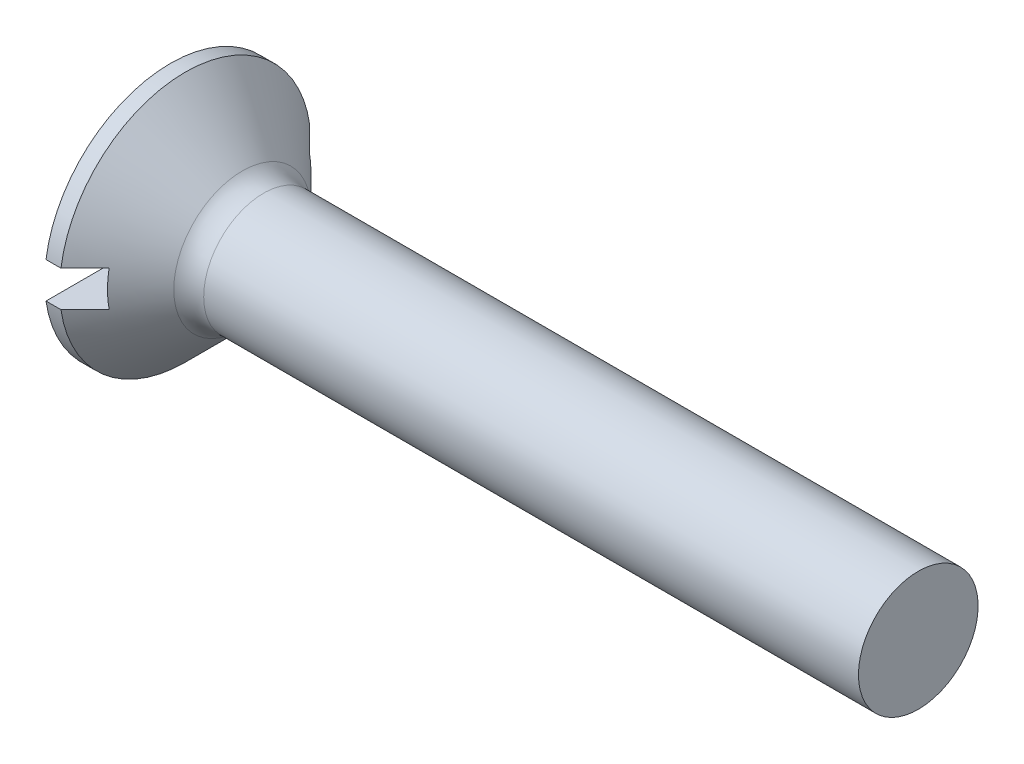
ISO-10303-21;
HEADER;
FILE_DESCRIPTION(('STEP AP214'),'2;1');
FILE_NAME('part.step','',(''),(''),'','','');
FILE_SCHEMA(('AUTOMOTIVE_DESIGN { 1 0 10303 214 1 1 1 1 }'));
ENDSEC;
DATA;
#1=APPLICATION_CONTEXT('core data for automotive mechanical design processes');
#2=APPLICATION_PROTOCOL_DEFINITION('international standard','automotive_design',2000,#1);
#3=PRODUCT_CONTEXT('',#1,'mechanical');
#4=PRODUCT('Part','Part','',(#3));
#5=PRODUCT_RELATED_PRODUCT_CATEGORY('part','',(#4));
#6=PRODUCT_DEFINITION_FORMATION('','',#4);
#7=PRODUCT_DEFINITION_CONTEXT('part definition',#1,'design');
#8=PRODUCT_DEFINITION('design','',#6,#7);
#9=PRODUCT_DEFINITION_SHAPE('','',#8);
#10=(LENGTH_UNIT() NAMED_UNIT(*) SI_UNIT(.MILLI.,.METRE.));
#11=(NAMED_UNIT(*) PLANE_ANGLE_UNIT() SI_UNIT($,.RADIAN.));
#12=(NAMED_UNIT(*) SI_UNIT($,.STERADIAN.) SOLID_ANGLE_UNIT());
#13=UNCERTAINTY_MEASURE_WITH_UNIT(LENGTH_MEASURE(1.E-05),#10,'distance_accuracy_value','');
#14=(GEOMETRIC_REPRESENTATION_CONTEXT(3) GLOBAL_UNCERTAINTY_ASSIGNED_CONTEXT((#13)) GLOBAL_UNIT_ASSIGNED_CONTEXT((#10,
#11,#12)) REPRESENTATION_CONTEXT('',''));
#15=CARTESIAN_POINT('',(0.,0.,0.));
#16=DIRECTION('',(0.,0.,1.));
#17=DIRECTION('',(1.,0.,0.));
#18=AXIS2_PLACEMENT_3D('',#15,#16,#17);
#19=CARTESIAN_POINT('',(0.,0.,0.));
#20=DIRECTION('',(-1.,0.,0.));
#21=DIRECTION('',(0.,0.,1.));
#22=AXIS2_PLACEMENT_3D('',#19,#20,#21);
#23=PLANE('',#22);
#24=DIRECTION('',(0.,0.,-1.));
#25=VECTOR('',#24,1.);
#26=CARTESIAN_POINT('',(0.,0.6,4.2));
#27=LINE('',#26,#25);
#28=CARTESIAN_POINT('',(0.,0.6,4.15692193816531));
#29=VERTEX_POINT('',#28);
#30=CARTESIAN_POINT('',(0.,0.599999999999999,-4.15692193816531));
#31=VERTEX_POINT('',#30);
#32=EDGE_CURVE('E174',#29,#31,#27,.T.);
#33=ORIENTED_EDGE('',*,*,#32,.F.);
#34=CARTESIAN_POINT('',(0.,0.,0.));
#35=DIRECTION('',(-1.,0.,0.));
#36=DIRECTION('',(0.,0.,1.));
#37=AXIS2_PLACEMENT_3D('',#34,#35,#36);
#38=CIRCLE('',#37,4.2);
#39=EDGE_CURVE('E118',#29,#31,#38,.T.);
#40=ORIENTED_EDGE('',*,*,#39,.T.);
#41=EDGE_LOOP('',(#33,#40));
#42=FACE_BOUND('',#41,.T.);
#43=ADVANCED_FACE('F37',(#42),#23,.T.);
#44=CARTESIAN_POINT('',(-6.34999999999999,0.,0.));
#45=DIRECTION('',(-1.,0.,0.));
#46=DIRECTION('',(0.,0.,1.));
#47=AXIS2_PLACEMENT_3D('',#44,#45,#46);
#48=CYLINDRICAL_SURFACE('',#47,4.2);
#49=DIRECTION('',(-1.,0.,0.));
#50=VECTOR('',#49,1.);
#51=CARTESIAN_POINT('',(-6.34999999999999,0.599999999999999,-4.15692193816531));
#52=LINE('',#51,#50);
#53=CARTESIAN_POINT('',(0.500000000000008,0.599999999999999,-4.15692193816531));
#54=VERTEX_POINT('',#53);
#55=EDGE_CURVE('E65',#31,#54,#52,.F.);
#56=ORIENTED_EDGE('',*,*,#55,.F.);
#57=ORIENTED_EDGE('',*,*,#39,.F.);
#58=DIRECTION('',(-1.,0.,0.));
#59=VECTOR('',#58,1.);
#60=CARTESIAN_POINT('',(-6.34999999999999,0.6,4.15692193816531));
#61=LINE('',#60,#59);
#62=CARTESIAN_POINT('',(0.500000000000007,0.6,4.15692193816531));
#63=VERTEX_POINT('',#62);
#64=EDGE_CURVE('E180',#63,#29,#61,.T.);
#65=ORIENTED_EDGE('',*,*,#64,.F.);
#66=CARTESIAN_POINT('',(0.500000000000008,0.,0.));
#67=DIRECTION('',(-1.,0.,0.));
#68=DIRECTION('',(0.,0.,1.));
#69=AXIS2_PLACEMENT_3D('',#66,#67,#68);
#70=CIRCLE('',#69,4.2);
#71=EDGE_CURVE('E112',#63,#54,#70,.T.);
#72=ORIENTED_EDGE('',*,*,#71,.T.);
#73=EDGE_LOOP('',(#56,#57,#65,#72));
#74=FACE_BOUND('',#73,.T.);
#75=ADVANCED_FACE('F158',(#74),#48,.T.);
#76=DIRECTION('',(0.,0.,1.));
#77=VECTOR('',#76,1.);
#78=CARTESIAN_POINT('',(0.,-0.600000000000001,-4.2));
#79=LINE('',#78,#77);
#80=CARTESIAN_POINT('',(0.,-0.600000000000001,-4.15692193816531));
#81=VERTEX_POINT('',#80);
#82=CARTESIAN_POINT('',(0.,-0.600000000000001,4.15692193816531));
#83=VERTEX_POINT('',#82);
#84=EDGE_CURVE('E106',#81,#83,#79,.T.);
#85=ORIENTED_EDGE('',*,*,#84,.F.);
#86=EDGE_CURVE('E114',#81,#83,#38,.T.);
#87=ORIENTED_EDGE('',*,*,#86,.T.);
#88=EDGE_LOOP('',(#85,#87));
#89=FACE_BOUND('',#88,.T.);
#90=ADVANCED_FACE('F160',(#89),#23,.T.);
#91=DIRECTION('',(-1.,0.,0.));
#92=VECTOR('',#91,1.);
#93=CARTESIAN_POINT('',(-6.34999999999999,-0.600000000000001,4.15692193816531));
#94=LINE('',#93,#92);
#95=CARTESIAN_POINT('',(0.500000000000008,-0.600000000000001,4.15692193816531));
#96=VERTEX_POINT('',#95);
#97=EDGE_CURVE('E179',#83,#96,#94,.F.);
#98=ORIENTED_EDGE('',*,*,#97,.F.);
#99=ORIENTED_EDGE('',*,*,#86,.F.);
#100=DIRECTION('',(-1.,0.,0.));
#101=VECTOR('',#100,1.);
#102=CARTESIAN_POINT('',(-6.34999999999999,-0.600000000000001,-4.15692193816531));
#103=LINE('',#102,#101);
#104=CARTESIAN_POINT('',(0.500000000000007,-0.600000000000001,-4.15692193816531));
#105=VERTEX_POINT('',#104);
#106=EDGE_CURVE('E177',#105,#81,#103,.T.);
#107=ORIENTED_EDGE('',*,*,#106,.F.);
#108=EDGE_CURVE('E115',#105,#96,#70,.T.);
#109=ORIENTED_EDGE('',*,*,#108,.T.);
#110=EDGE_LOOP('',(#98,#99,#107,#109));
#111=FACE_BOUND('',#110,.T.);
#112=ADVANCED_FACE('F155',(#111),#48,.T.);
#113=CARTESIAN_POINT('',(0.500000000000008,0.,0.));
#114=DIRECTION('',(-1.,0.,0.));
#115=DIRECTION('',(0.,0.,1.));
#116=AXIS2_PLACEMENT_3D('',#113,#114,#115);
#117=CONICAL_SURFACE('',#116,4.2,0.78539816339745);
#118=CARTESIAN_POINT('',(-4.56300554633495,0.599999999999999,-9.24355298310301));
#119=CARTESIAN_POINT('',(-4.24600723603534,0.599999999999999,-8.9258823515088));
#120=CARTESIAN_POINT('',(-3.92903833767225,0.599999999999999,-8.60818235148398));
#121=CARTESIAN_POINT('',(-3.29519089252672,0.599999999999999,-7.97268003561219));
#122=CARTESIAN_POINT('',(-2.97831234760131,0.599999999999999,-7.65487771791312));
#123=CARTESIAN_POINT('',(-2.34455187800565,0.599999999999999,-7.01900148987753));
#124=CARTESIAN_POINT('',(-2.02767001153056,0.599999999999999,-6.70092752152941));
#125=CARTESIAN_POINT('',(-1.39411705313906,0.599999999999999,-6.06458161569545));
#126=CARTESIAN_POINT('',(-1.07744595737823,0.599999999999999,-5.74630968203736));
#127=CARTESIAN_POINT('',(-0.439782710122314,0.599999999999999,-5.1047678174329));
#128=CARTESIAN_POINT('',(-0.118795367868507,0.599999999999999,-4.78149310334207));
#129=CARTESIAN_POINT('',(0.362237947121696,0.599999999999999,-4.2961185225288));
#130=CARTESIAN_POINT('',(0.522512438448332,0.599999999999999,-4.13424518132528));
#131=CARTESIAN_POINT('',(0.842841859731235,0.599999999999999,-3.81028322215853));
#132=CARTESIAN_POINT('',(1.00289679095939,0.6,-3.64819460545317));
#133=CARTESIAN_POINT('',(1.32264436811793,0.6,-3.32374686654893));
#134=CARTESIAN_POINT('',(1.48233710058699,0.6,-3.16138782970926));
#135=CARTESIAN_POINT('',(1.80122734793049,0.6,-2.83617699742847));
#136=CARTESIAN_POINT('',(1.96042485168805,0.6,-2.67332519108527));
#137=CARTESIAN_POINT('',(2.27798310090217,0.6,-2.346837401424));
#138=CARTESIAN_POINT('',(2.43634393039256,0.6,-2.1832015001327));
#139=CARTESIAN_POINT('',(2.67269924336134,0.6,-1.93661567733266));
#140=CARTESIAN_POINT('',(2.75128528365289,0.6,-1.8542332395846));
#141=CARTESIAN_POINT('',(2.90787263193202,0.6,-1.68891500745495));
#142=CARTESIAN_POINT('',(2.98587394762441,0.6,-1.60597922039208));
#143=CARTESIAN_POINT('',(3.10544684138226,0.6,-1.47745401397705));
#144=CARTESIAN_POINT('',(3.14733724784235,0.6,-1.43216144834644));
#145=CARTESIAN_POINT('',(3.23076972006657,0.6,-1.34125476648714));
#146=CARTESIAN_POINT('',(3.27231177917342,0.6,-1.29564064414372));
#147=CARTESIAN_POINT('',(3.35490511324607,0.6,-1.20402456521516));
#148=CARTESIAN_POINT('',(3.39595670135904,0.6,-1.15802289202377));
#149=CARTESIAN_POINT('',(3.47741398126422,0.6,-1.06545539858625));
#150=CARTESIAN_POINT('',(3.51781969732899,0.6,-1.01888959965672));
#151=CARTESIAN_POINT('',(3.61534617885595,0.6,-0.904304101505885));
#152=CARTESIAN_POINT('',(3.67198890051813,0.6,-0.835870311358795));
#153=CARTESIAN_POINT('',(3.75443491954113,0.6,-0.731128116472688));
#154=CARTESIAN_POINT('',(3.78151872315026,0.6,-0.695835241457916));
#155=CARTESIAN_POINT('',(3.83442818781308,0.6,-0.624333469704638));
#156=CARTESIAN_POINT('',(3.86025411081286,0.6,-0.588124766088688));
#157=CARTESIAN_POINT('',(3.91931375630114,0.6,-0.500871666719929));
#158=CARTESIAN_POINT('',(3.95177061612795,0.6,-0.449276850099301));
#159=CARTESIAN_POINT('',(3.99577967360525,0.6,-0.369336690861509));
#160=CARTESIAN_POINT('',(4.00966067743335,0.6,-0.342288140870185));
#161=CARTESIAN_POINT('',(4.03525638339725,0.6,-0.287195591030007));
#162=CARTESIAN_POINT('',(4.04697271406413,0.6,-0.259152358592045));
#163=CARTESIAN_POINT('',(4.06984222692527,0.6,-0.195380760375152));
#164=CARTESIAN_POINT('',(4.08024433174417,0.6,-0.159369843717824));
#165=CARTESIAN_POINT('',(4.09489065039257,0.6,-0.0861793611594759));
#166=CARTESIAN_POINT('',(4.09915715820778,0.6,-0.049004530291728));
#167=CARTESIAN_POINT('',(4.10061628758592,0.6,0.0256851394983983));
#168=CARTESIAN_POINT('',(4.09777267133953,0.6,0.0632007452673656));
#169=CARTESIAN_POINT('',(4.08560858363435,0.6,0.137201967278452));
#170=CARTESIAN_POINT('',(4.0762699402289,0.6,0.173684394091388));
#171=CARTESIAN_POINT('',(4.05240105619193,0.6,0.246171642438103));
#172=CARTESIAN_POINT('',(4.03770931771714,0.6,0.282120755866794));
#173=CARTESIAN_POINT('',(4.0048507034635,0.6,0.352421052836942));
#174=CARTESIAN_POINT('',(3.98667753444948,0.6,0.386769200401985));
#175=CARTESIAN_POINT('',(3.94786976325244,0.6,0.454391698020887));
#176=CARTESIAN_POINT('',(3.92721638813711,0.6,0.487655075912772));
#177=CARTESIAN_POINT('',(3.88433578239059,0.6,0.553097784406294));
#178=CARTESIAN_POINT('',(3.86210991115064,0.6,0.585278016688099));
#179=CARTESIAN_POINT('',(3.81457382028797,0.6,0.651581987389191));
#180=CARTESIAN_POINT('',(3.7891630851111,0.6,0.685633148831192));
#181=CARTESIAN_POINT('',(3.73740972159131,0.6,0.75302228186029));
#182=CARTESIAN_POINT('',(3.71106696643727,0.6,0.786360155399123));
#183=CARTESIAN_POINT('',(3.63101189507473,0.6,0.885596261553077));
#184=CARTESIAN_POINT('',(3.57629754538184,0.6,0.950683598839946));
#185=CARTESIAN_POINT('',(3.46525380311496,0.6,1.07965626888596));
#186=CARTESIAN_POINT('',(3.40892163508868,0.6,1.14353918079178));
#187=CARTESIAN_POINT('',(3.29530585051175,0.6,1.27041803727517));
#188=CARTESIAN_POINT('',(3.23802251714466,0.6,1.33341423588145));
#189=CARTESIAN_POINT('',(3.12298479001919,0.6,1.45862383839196));
#190=CARTESIAN_POINT('',(3.06523233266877,0.6,1.52083902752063));
#191=CARTESIAN_POINT('',(2.94927074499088,0.6,1.64485037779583));
#192=CARTESIAN_POINT('',(2.89106158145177,0.6,1.70664650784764));
#193=CARTESIAN_POINT('',(2.71607782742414,0.6,1.89143620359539));
#194=CARTESIAN_POINT('',(2.598818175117,0.6,2.01396998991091));
#195=CARTESIAN_POINT('',(2.36411448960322,0.6,2.25774708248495));
#196=CARTESIAN_POINT('',(2.24667393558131,0.6,2.37899374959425));
#197=CARTESIAN_POINT('',(2.01132064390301,0.6,2.6210282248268));
#198=CARTESIAN_POINT('',(1.89340790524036,0.6,2.74181603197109));
#199=CARTESIAN_POINT('',(1.53920067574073,0.6,3.10372997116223));
#200=CARTESIAN_POINT('',(1.30244210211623,0.6,3.3444015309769));
#201=CARTESIAN_POINT('',(0.82819572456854,0.6,3.82523070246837));
#202=CARTESIAN_POINT('',(0.5907076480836,0.6,4.06538804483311));
#203=CARTESIAN_POINT('',(0.115359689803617,0.6,4.54532999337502));
#204=CARTESIAN_POINT('',(-0.122500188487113,0.6,4.7851146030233));
#205=CARTESIAN_POINT('',(-0.598435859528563,0.6,5.26442998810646));
#206=CARTESIAN_POINT('',(-0.836511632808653,0.6,5.50396078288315));
#207=CARTESIAN_POINT('',(-1.31282357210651,0.6,5.98286400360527));
#208=CARTESIAN_POINT('',(-1.55105973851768,0.600000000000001,6.22223642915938));
#209=CARTESIAN_POINT('',(-2.26588146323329,0.600000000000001,6.94013600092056));
#210=CARTESIAN_POINT('',(-2.74263267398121,0.600000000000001,7.41849819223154));
#211=CARTESIAN_POINT('',(-3.33143893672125,0.600000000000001,8.00899983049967));
#212=CARTESIAN_POINT('',(-3.44338145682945,0.600000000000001,8.1212515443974));
#213=CARTESIAN_POINT('',(-3.66728071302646,0.600000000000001,8.34574469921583));
#214=CARTESIAN_POINT('',(-3.7792374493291,0.600000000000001,8.45798613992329));
#215=CARTESIAN_POINT('',(-4.00315821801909,0.600000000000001,8.68245495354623));
#216=CARTESIAN_POINT('',(-4.11512225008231,0.600000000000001,8.79468232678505));
#217=CARTESIAN_POINT('',(-4.33905795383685,0.600000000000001,9.01912554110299));
#218=CARTESIAN_POINT('',(-4.45102962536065,0.600000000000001,9.13134138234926));
#219=CARTESIAN_POINT('',(-4.56300554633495,0.600000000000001,9.24355298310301));
#220=B_SPLINE_CURVE_WITH_KNOTS('',3,(#118,#119,#120,#121,#122,#123,#124,#125,#126,#127,#128,
#129,#130,#131,#132,#133,#134,#135,#136,#137,#138,#139,#140,#141,#142,#143,#144,#145,#146,#147,
#148,#149,#150,#151,#152,#153,#154,#155,#156,#157,#158,#159,#160,#161,#162,#163,#164,#165,#166,
#167,#168,#169,#170,#171,#172,#173,#174,#175,#176,#177,#178,#179,#180,#181,#182,#183,#184,#185,
#186,#187,#188,#189,#190,#191,#192,#193,#194,#195,#196,#197,#198,#199,#200,#201,#202,#203,#204,
#205,#206,#207,#208,#209,#210,#211,#212,#213,#214,#215,#216,#217,#218,#219),.UNSPECIFIED.,.F.,
.F.,(4,2,2,2,2,2,2,2,2,2,2,2,2,2,2,2,2,2,2,2,2,2,2,2,2,2,2,2,2,2,2,2,2,2,2,2,2,2,2,2,2,2,2,2,2,
2,2,2,2,2,4),(0.,1.34633691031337,2.6926997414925,4.03964677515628,5.38656852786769,
6.75326280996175,7.43664982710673,8.12003286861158,8.80323043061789,9.48644321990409,
10.1695860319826,10.5111450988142,10.8526996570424,11.03778202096,11.2228679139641,
11.4078285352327,11.5927821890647,11.8592146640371,11.9926530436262,12.1260635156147,
12.3086320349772,12.399769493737,12.490838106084,12.6028793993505,12.7145125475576,
12.8267158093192,12.939234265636,13.0554743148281,13.1719265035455,13.2893234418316,
13.4066201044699,13.5340600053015,13.6615173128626,13.91655652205,14.1720630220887,
14.4274947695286,14.6821578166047,14.9368395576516,15.4456347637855,15.9520298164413,
16.4584259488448,17.4712394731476,18.484493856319,19.4977387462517,20.5108998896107,
21.5240635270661,23.5501676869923,24.0257559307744,24.5013524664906,24.9769345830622,
25.4525083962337),.UNSPECIFIED.);
#221=CARTESIAN_POINT('',(1.3,0.6,3.34664010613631));
#222=VERTEX_POINT('',#221);
#223=EDGE_CURVE('E11',#222,#63,#220,.T.);
#224=ORIENTED_EDGE('',*,*,#223,.F.);
#225=CARTESIAN_POINT('',(1.3,0.,0.));
#226=DIRECTION('',(1.,0.,0.));
#227=DIRECTION('',(0.,0.,-1.));
#228=AXIS2_PLACEMENT_3D('',#225,#226,#227);
#229=CIRCLE('',#228,3.40000000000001);
#230=CARTESIAN_POINT('',(1.3,-0.600000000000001,3.34664010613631));
#231=VERTEX_POINT('',#230);
#232=EDGE_CURVE('E94',#231,#222,#229,.F.);
#233=ORIENTED_EDGE('',*,*,#232,.F.);
#234=CARTESIAN_POINT('',(-4.56300554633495,-0.600000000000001,9.24355298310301));
#235=CARTESIAN_POINT('',(-4.24600723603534,-0.600000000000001,8.9258823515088));
#236=CARTESIAN_POINT('',(-3.92903833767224,-0.600000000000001,8.60818235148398));
#237=CARTESIAN_POINT('',(-3.29519089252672,-0.600000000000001,7.97268003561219));
#238=CARTESIAN_POINT('',(-2.9783123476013,-0.600000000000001,7.65487771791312));
#239=CARTESIAN_POINT('',(-2.34455187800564,-0.600000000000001,7.01900148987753));
#240=CARTESIAN_POINT('',(-2.02767001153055,-0.600000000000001,6.70092752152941));
#241=CARTESIAN_POINT('',(-1.39411705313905,-0.600000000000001,6.06458161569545));
#242=CARTESIAN_POINT('',(-1.07744595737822,-0.600000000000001,5.74630968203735));
#243=CARTESIAN_POINT('',(-0.439782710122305,-0.600000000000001,5.10476781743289));
#244=CARTESIAN_POINT('',(-0.1187953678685,-0.600000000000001,4.78149310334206));
#245=CARTESIAN_POINT('',(0.362237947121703,-0.600000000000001,4.29611852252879));
#246=CARTESIAN_POINT('',(0.522512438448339,-0.600000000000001,4.13424518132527));
#247=CARTESIAN_POINT('',(0.842841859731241,-0.600000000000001,3.81028322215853));
#248=CARTESIAN_POINT('',(1.00289679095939,-0.600000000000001,3.64819460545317));
#249=CARTESIAN_POINT('',(1.32264436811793,-0.600000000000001,3.32374686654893));
#250=CARTESIAN_POINT('',(1.482337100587,-0.600000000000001,3.16138782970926));
#251=CARTESIAN_POINT('',(1.80122734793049,-0.600000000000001,2.83617699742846));
#252=CARTESIAN_POINT('',(1.96042485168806,-0.600000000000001,2.67332519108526));
#253=CARTESIAN_POINT('',(2.27798310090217,-0.600000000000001,2.346837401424));
#254=CARTESIAN_POINT('',(2.43634393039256,-0.600000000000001,2.1832015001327));
#255=CARTESIAN_POINT('',(2.67269924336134,-0.600000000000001,1.93661567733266));
#256=CARTESIAN_POINT('',(2.75128528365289,-0.600000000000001,1.8542332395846));
#257=CARTESIAN_POINT('',(2.90787263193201,-0.600000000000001,1.68891500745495));
#258=CARTESIAN_POINT('',(2.98587394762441,-0.600000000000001,1.60597922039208));
#259=CARTESIAN_POINT('',(3.10544684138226,-0.600000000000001,1.47745401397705));
#260=CARTESIAN_POINT('',(3.14733724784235,-0.600000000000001,1.43216144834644));
#261=CARTESIAN_POINT('',(3.23076972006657,-0.600000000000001,1.34125476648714));
#262=CARTESIAN_POINT('',(3.27231177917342,-0.600000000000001,1.29564064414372));
#263=CARTESIAN_POINT('',(3.35490511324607,-0.600000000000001,1.20402456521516));
#264=CARTESIAN_POINT('',(3.39595670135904,-0.600000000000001,1.15802289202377));
#265=CARTESIAN_POINT('',(3.47741398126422,-0.600000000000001,1.06545539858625));
#266=CARTESIAN_POINT('',(3.51781969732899,-0.600000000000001,1.01888959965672));
#267=CARTESIAN_POINT('',(3.61534617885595,-0.600000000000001,0.904304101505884));
#268=CARTESIAN_POINT('',(3.67198890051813,-0.600000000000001,0.835870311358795));
#269=CARTESIAN_POINT('',(3.75443491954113,-0.600000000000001,0.731128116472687));
#270=CARTESIAN_POINT('',(3.78151872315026,-0.600000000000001,0.695835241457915));
#271=CARTESIAN_POINT('',(3.83442818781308,-0.600000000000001,0.624333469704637));
#272=CARTESIAN_POINT('',(3.86025411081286,-0.600000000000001,0.588124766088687));
#273=CARTESIAN_POINT('',(3.91931375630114,-0.600000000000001,0.500871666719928));
#274=CARTESIAN_POINT('',(3.95177061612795,-0.600000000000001,0.449276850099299));
#275=CARTESIAN_POINT('',(3.99577967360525,-0.600000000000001,0.369336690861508));
#276=CARTESIAN_POINT('',(4.00966067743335,-0.600000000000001,0.342288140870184));
#277=CARTESIAN_POINT('',(4.03525638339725,-0.600000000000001,0.287195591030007));
#278=CARTESIAN_POINT('',(4.04697271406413,-0.600000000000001,0.259152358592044));
#279=CARTESIAN_POINT('',(4.06984222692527,-0.600000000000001,0.195380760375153));
#280=CARTESIAN_POINT('',(4.08024433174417,-0.600000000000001,0.159369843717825));
#281=CARTESIAN_POINT('',(4.09489065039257,-0.600000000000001,0.086179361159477));
#282=CARTESIAN_POINT('',(4.09915715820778,-0.600000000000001,0.0490045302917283));
#283=CARTESIAN_POINT('',(4.10061628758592,-0.600000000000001,-0.025685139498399));
#284=CARTESIAN_POINT('',(4.09777267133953,-0.600000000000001,-0.0632007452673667));
#285=CARTESIAN_POINT('',(4.08560858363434,-0.600000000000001,-0.137201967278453));
#286=CARTESIAN_POINT('',(4.07626994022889,-0.600000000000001,-0.173684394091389));
#287=CARTESIAN_POINT('',(4.05240105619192,-0.600000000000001,-0.246171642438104));
#288=CARTESIAN_POINT('',(4.03770931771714,-0.600000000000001,-0.282120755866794));
#289=CARTESIAN_POINT('',(4.0048507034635,-0.600000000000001,-0.352421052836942));
#290=CARTESIAN_POINT('',(3.98667753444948,-0.600000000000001,-0.386769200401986));
#291=CARTESIAN_POINT('',(3.94786976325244,-0.600000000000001,-0.454391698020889));
#292=CARTESIAN_POINT('',(3.92721638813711,-0.600000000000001,-0.487655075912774));
#293=CARTESIAN_POINT('',(3.88433578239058,-0.600000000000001,-0.553097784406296));
#294=CARTESIAN_POINT('',(3.86210991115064,-0.600000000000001,-0.585278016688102));
#295=CARTESIAN_POINT('',(3.81457382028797,-0.600000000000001,-0.651581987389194));
#296=CARTESIAN_POINT('',(3.7891630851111,-0.600000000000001,-0.685633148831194));
#297=CARTESIAN_POINT('',(3.73740972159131,-0.600000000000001,-0.753022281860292));
#298=CARTESIAN_POINT('',(3.71106696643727,-0.600000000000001,-0.786360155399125));
#299=CARTESIAN_POINT('',(3.63101189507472,-0.600000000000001,-0.88559626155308));
#300=CARTESIAN_POINT('',(3.57629754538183,-0.600000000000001,-0.95068359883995));
#301=CARTESIAN_POINT('',(3.46525380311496,-0.600000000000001,-1.07965626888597));
#302=CARTESIAN_POINT('',(3.40892163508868,-0.600000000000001,-1.14353918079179));
#303=CARTESIAN_POINT('',(3.29530585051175,-0.600000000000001,-1.27041803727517));
#304=CARTESIAN_POINT('',(3.23802251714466,-0.600000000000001,-1.33341423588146));
#305=CARTESIAN_POINT('',(3.12298479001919,-0.600000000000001,-1.45862383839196));
#306=CARTESIAN_POINT('',(3.06523233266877,-0.600000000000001,-1.52083902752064));
#307=CARTESIAN_POINT('',(2.94927074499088,-0.600000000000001,-1.64485037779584));
#308=CARTESIAN_POINT('',(2.89106158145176,-0.600000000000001,-1.70664650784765));
#309=CARTESIAN_POINT('',(2.71607782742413,-0.600000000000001,-1.8914362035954));
#310=CARTESIAN_POINT('',(2.598818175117,-0.600000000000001,-2.01396998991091));
#311=CARTESIAN_POINT('',(2.36411448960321,-0.600000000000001,-2.25774708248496));
#312=CARTESIAN_POINT('',(2.2466739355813,-0.600000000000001,-2.37899374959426));
#313=CARTESIAN_POINT('',(2.011320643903,-0.600000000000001,-2.62102822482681));
#314=CARTESIAN_POINT('',(1.89340790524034,-0.600000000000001,-2.74181603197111));
#315=CARTESIAN_POINT('',(1.53920067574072,-0.600000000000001,-3.10372997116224));
#316=CARTESIAN_POINT('',(1.30244210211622,-0.600000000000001,-3.34440153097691));
#317=CARTESIAN_POINT('',(0.828195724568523,-0.600000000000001,-3.82523070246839));
#318=CARTESIAN_POINT('',(0.590707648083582,-0.600000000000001,-4.06538804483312));
#319=CARTESIAN_POINT('',(0.115359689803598,-0.600000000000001,-4.54532999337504));
#320=CARTESIAN_POINT('',(-0.122500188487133,-0.600000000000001,-4.78511460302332));
#321=CARTESIAN_POINT('',(-0.598435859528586,-0.600000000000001,-5.26442998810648));
#322=CARTESIAN_POINT('',(-0.836511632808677,-0.600000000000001,-5.50396078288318));
#323=CARTESIAN_POINT('',(-1.31282357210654,-0.600000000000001,-5.98286400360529));
#324=CARTESIAN_POINT('',(-1.55105973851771,-0.600000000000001,-6.22223642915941));
#325=CARTESIAN_POINT('',(-2.26588146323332,-0.600000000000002,-6.94013600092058));
#326=CARTESIAN_POINT('',(-2.74263267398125,-0.600000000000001,-7.41849819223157));
#327=CARTESIAN_POINT('',(-3.33143893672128,-0.600000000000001,-8.0089998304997));
#328=CARTESIAN_POINT('',(-3.44338145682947,-0.600000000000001,-8.12125154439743));
#329=CARTESIAN_POINT('',(-3.66728071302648,-0.600000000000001,-8.34574469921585));
#330=CARTESIAN_POINT('',(-3.77923744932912,-0.600000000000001,-8.45798613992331));
#331=CARTESIAN_POINT('',(-4.0031582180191,-0.600000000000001,-8.68245495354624));
#332=CARTESIAN_POINT('',(-4.11512225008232,-0.600000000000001,-8.79468232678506));
#333=CARTESIAN_POINT('',(-4.33905795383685,-0.600000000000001,-9.019125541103));
#334=CARTESIAN_POINT('',(-4.45102962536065,-0.600000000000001,-9.13134138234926));
#335=CARTESIAN_POINT('',(-4.56300554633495,-0.600000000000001,-9.24355298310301));
#336=B_SPLINE_CURVE_WITH_KNOTS('',3,(#234,#235,#236,#237,#238,#239,#240,#241,#242,#243,#244,
#245,#246,#247,#248,#249,#250,#251,#252,#253,#254,#255,#256,#257,#258,#259,#260,#261,#262,#263,
#264,#265,#266,#267,#268,#269,#270,#271,#272,#273,#274,#275,#276,#277,#278,#279,#280,#281,#282,
#283,#284,#285,#286,#287,#288,#289,#290,#291,#292,#293,#294,#295,#296,#297,#298,#299,#300,#301,
#302,#303,#304,#305,#306,#307,#308,#309,#310,#311,#312,#313,#314,#315,#316,#317,#318,#319,#320,
#321,#322,#323,#324,#325,#326,#327,#328,#329,#330,#331,#332,#333,#334,#335),.UNSPECIFIED.,.F.,
.F.,(4,2,2,2,2,2,2,2,2,2,2,2,2,2,2,2,2,2,2,2,2,2,2,2,2,2,2,2,2,2,2,2,2,2,2,2,2,2,2,2,2,2,2,2,2,
2,2,2,2,2,4),(0.,1.34633691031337,2.6926997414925,4.03964677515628,5.3865685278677,
6.75326280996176,7.43664982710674,8.12003286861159,8.8032304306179,9.48644321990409,
10.1695860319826,10.5111450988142,10.8526996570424,11.03778202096,11.2228679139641,
11.4078285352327,11.5927821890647,11.8592146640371,11.9926530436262,12.1260635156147,
12.3086320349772,12.399769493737,12.490838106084,12.6028793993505,12.7145125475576,
12.8267158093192,12.939234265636,13.0554743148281,13.1719265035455,13.2893234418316,
13.4066201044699,13.5340600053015,13.6615173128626,13.91655652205,14.1720630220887,
14.4274947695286,14.6821578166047,14.9368395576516,15.4456347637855,15.9520298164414,
16.4584259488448,17.4712394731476,18.484493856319,19.4977387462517,20.5108998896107,
21.5240635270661,23.5501676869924,24.0257559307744,24.5013524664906,24.9769345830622,
25.4525083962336),.UNSPECIFIED.);
#337=EDGE_CURVE('E51',#96,#231,#336,.T.);
#338=ORIENTED_EDGE('',*,*,#337,.F.);
#339=ORIENTED_EDGE('',*,*,#108,.F.);
#340=CARTESIAN_POINT('',(1.3,-0.600000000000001,-3.34664010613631));
#341=VERTEX_POINT('',#340);
#342=EDGE_CURVE('E130',#341,#105,#336,.T.);
#343=ORIENTED_EDGE('',*,*,#342,.F.);
#344=CARTESIAN_POINT('',(1.3,0.6,-3.34664010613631));
#345=VERTEX_POINT('',#344);
#346=EDGE_CURVE('E102',#345,#341,#229,.F.);
#347=ORIENTED_EDGE('',*,*,#346,.F.);
#348=EDGE_CURVE('E41',#54,#345,#220,.T.);
#349=ORIENTED_EDGE('',*,*,#348,.F.);
#350=ORIENTED_EDGE('',*,*,#71,.F.);
#351=EDGE_LOOP('',(#224,#233,#338,#339,#343,#347,#349,#350));
#352=FACE_BOUND('',#351,.T.);
#353=CARTESIAN_POINT('',(2.40710678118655,0.,0.));
#354=DIRECTION('',(-1.,0.,0.));
#355=DIRECTION('',(0.,0.,1.));
#356=AXIS2_PLACEMENT_3D('',#353,#354,#355);
#357=CIRCLE('',#356,2.29289321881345);
#358=CARTESIAN_POINT('',(2.40710678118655,0.,2.29289321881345));
#359=VERTEX_POINT('',#358);
#360=EDGE_CURVE('E125',#359,#359,#357,.T.);
#361=ORIENTED_EDGE('',*,*,#360,.T.);
#362=EDGE_LOOP('',(#361));
#363=FACE_BOUND('',#362,.T.);
#364=ADVANCED_FACE('F109',(#352,#363),#117,.T.);
#365=CARTESIAN_POINT('',(-6.34999999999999,0.,0.));
#366=DIRECTION('',(-1.,0.,0.));
#367=DIRECTION('',(0.,0.,1.));
#368=AXIS2_PLACEMENT_3D('',#365,#366,#367);
#369=CYLINDRICAL_SURFACE('',#368,2.);
#370=CARTESIAN_POINT('',(3.1142135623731,0.,0.));
#371=DIRECTION('',(-1.,0.,0.));
#372=DIRECTION('',(0.,0.,1.));
#373=AXIS2_PLACEMENT_3D('',#370,#371,#372);
#374=CIRCLE('',#373,2.);
#375=CARTESIAN_POINT('',(3.1142135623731,0.,2.));
#376=VERTEX_POINT('',#375);
#377=EDGE_CURVE('E128',#376,#376,#374,.F.);
#378=ORIENTED_EDGE('',*,*,#377,.T.);
#379=EDGE_LOOP('',(#378));
#380=FACE_BOUND('',#379,.T.);
#381=CARTESIAN_POINT('',(25.,0.,0.));
#382=DIRECTION('',(-1.,0.,0.));
#383=DIRECTION('',(0.,0.,1.));
#384=AXIS2_PLACEMENT_3D('',#381,#382,#383);
#385=CIRCLE('',#384,2.);
#386=CARTESIAN_POINT('',(25.,0.,2.));
#387=VERTEX_POINT('',#386);
#388=EDGE_CURVE('E121',#387,#387,#385,.T.);
#389=ORIENTED_EDGE('',*,*,#388,.T.);
#390=EDGE_LOOP('',(#389));
#391=FACE_BOUND('',#390,.T.);
#392=ADVANCED_FACE('F148',(#380,#391),#369,.T.);
#393=CARTESIAN_POINT('',(25.,2.,0.));
#394=DIRECTION('',(1.,0.,0.));
#395=DIRECTION('',(0.,0.,-1.));
#396=AXIS2_PLACEMENT_3D('',#393,#394,#395);
#397=PLANE('',#396);
#398=ORIENTED_EDGE('',*,*,#388,.F.);
#399=EDGE_LOOP('',(#398));
#400=FACE_BOUND('',#399,.T.);
#401=ADVANCED_FACE('F146',(#400),#397,.T.);
#402=CARTESIAN_POINT('',(3.1142135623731,0.,0.));
#403=DIRECTION('',(-1.,0.,0.));
#404=DIRECTION('',(0.,0.,1.));
#405=AXIS2_PLACEMENT_3D('',#402,#403,#404);
#406=TOROIDAL_SURFACE('',#405,3.,1.);
#407=ORIENTED_EDGE('',*,*,#377,.F.);
#408=EDGE_LOOP('',(#407));
#409=FACE_BOUND('',#408,.T.);
#410=ORIENTED_EDGE('',*,*,#360,.F.);
#411=EDGE_LOOP('',(#410));
#412=FACE_BOUND('',#411,.T.);
#413=ADVANCED_FACE('F39',(#409,#412),#406,.F.);
#414=CARTESIAN_POINT('',(1.3,0.6,4.2));
#415=DIRECTION('',(0.,1.,0.));
#416=DIRECTION('',(0.,0.,1.));
#417=AXIS2_PLACEMENT_3D('',#414,#415,#416);
#418=PLANE('',#417);
#419=ORIENTED_EDGE('',*,*,#55,.T.);
#420=ORIENTED_EDGE('',*,*,#348,.T.);
#421=DIRECTION('',(0.,0.,-1.));
#422=VECTOR('',#421,1.);
#423=CARTESIAN_POINT('',(1.3,0.6,4.2));
#424=LINE('',#423,#422);
#425=EDGE_CURVE('E58',#222,#345,#424,.T.);
#426=ORIENTED_EDGE('',*,*,#425,.F.);
#427=ORIENTED_EDGE('',*,*,#223,.T.);
#428=ORIENTED_EDGE('',*,*,#64,.T.);
#429=ORIENTED_EDGE('',*,*,#32,.T.);
#430=EDGE_LOOP('',(#419,#420,#426,#427,#428,#429));
#431=FACE_BOUND('',#430,.T.);
#432=ADVANCED_FACE('F103',(#431),#418,.F.);
#433=CARTESIAN_POINT('',(1.3,-0.600000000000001,-4.2));
#434=DIRECTION('',(0.,-1.,0.));
#435=DIRECTION('',(0.,0.,-1.));
#436=AXIS2_PLACEMENT_3D('',#433,#434,#435);
#437=PLANE('',#436);
#438=ORIENTED_EDGE('',*,*,#97,.T.);
#439=ORIENTED_EDGE('',*,*,#337,.T.);
#440=DIRECTION('',(0.,0.,1.));
#441=VECTOR('',#440,1.);
#442=CARTESIAN_POINT('',(1.3,-0.600000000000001,-4.2));
#443=LINE('',#442,#441);
#444=EDGE_CURVE('E97',#341,#231,#443,.T.);
#445=ORIENTED_EDGE('',*,*,#444,.F.);
#446=ORIENTED_EDGE('',*,*,#342,.T.);
#447=ORIENTED_EDGE('',*,*,#106,.T.);
#448=ORIENTED_EDGE('',*,*,#84,.T.);
#449=EDGE_LOOP('',(#438,#439,#445,#446,#447,#448));
#450=FACE_BOUND('',#449,.T.);
#451=ADVANCED_FACE('F138',(#450),#437,.F.);
#452=CARTESIAN_POINT('',(1.3,-0.600000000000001,-4.2));
#453=DIRECTION('',(1.,0.,0.));
#454=DIRECTION('',(0.,0.,-1.));
#455=AXIS2_PLACEMENT_3D('',#452,#453,#454);
#456=PLANE('',#455);
#457=ORIENTED_EDGE('',*,*,#232,.T.);
#458=ORIENTED_EDGE('',*,*,#425,.T.);
#459=ORIENTED_EDGE('',*,*,#346,.T.);
#460=ORIENTED_EDGE('',*,*,#444,.T.);
#461=EDGE_LOOP('',(#457,#458,#459,#460));
#462=FACE_BOUND('',#461,.T.);
#463=ADVANCED_FACE('F95',(#462),#456,.F.);
#464=CLOSED_SHELL('',(#43,#75,#90,#112,#364,#392,#401,#413,#432,#451,#463));
#465=MANIFOLD_SOLID_BREP('B2',#464);
#466=ADVANCED_BREP_SHAPE_REPRESENTATION('',(#18,#465),#14);
#467=SHAPE_DEFINITION_REPRESENTATION(#9,#466);
ENDSEC;
END-ISO-10303-21;
